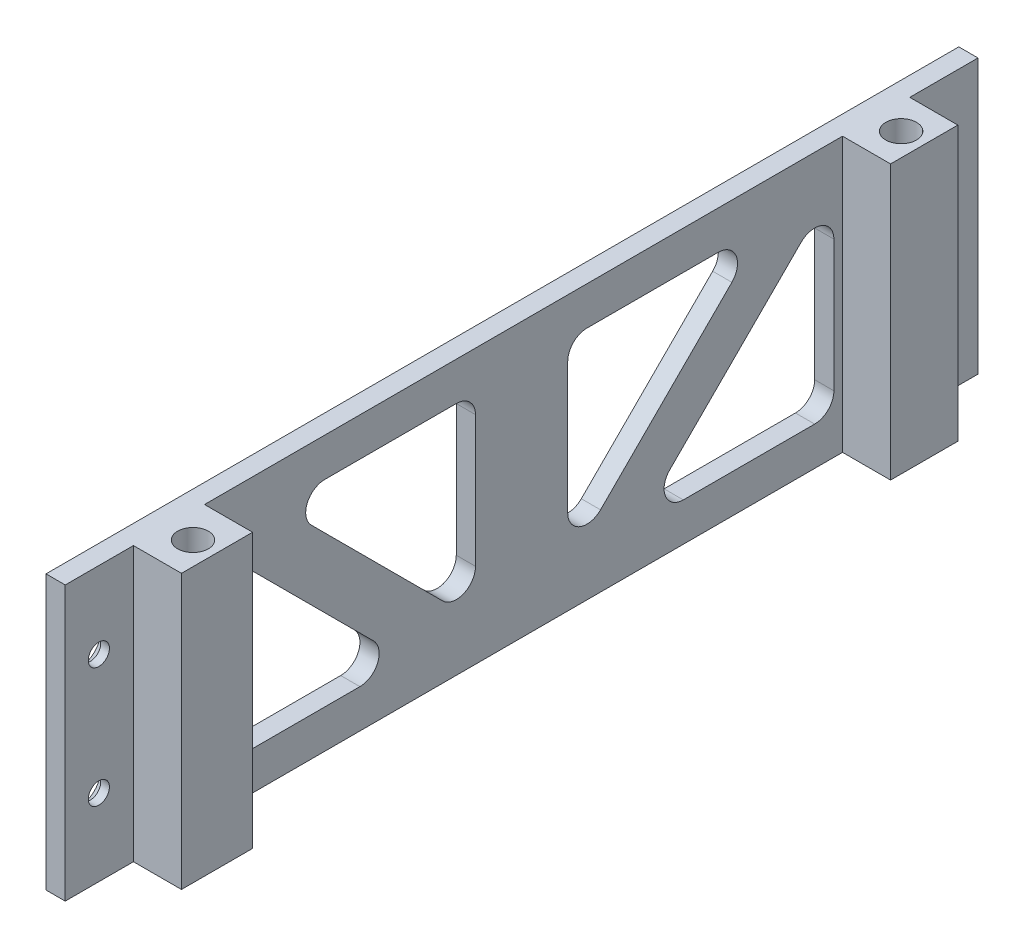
from build123d import *

# Parameters (mm, degrees)
SKETCH1_W                                           = 95
SKETCH1_H                                           = 28.5
BOSS_EXTRUDE1_DEPTH                                 = 2
SKETCH3_W                                           = 7.4
SKETCH3_H                                           = 28.5
SKETCH3_W_2                                         = 7
BOSS_EXTRUDE3_DEPTH                                 = 5
F_3_2_3_2_DIAMETER_HOLE1_D                          = 3.2
CSK_FOR_M2_COUNTERSUNK_FLAT_HEAD_SCREW1_D           = 2.2
CSK_FOR_M2_COUNTERSUNK_FLAT_HEAD_SCREW1_DEPTH       = 2
CSK_FOR_M2_COUNTERSUNK_FLAT_HEAD_SCREW1_CSINK_D     = 4.4
CSK_FOR_M2_COUNTERSUNK_FLAT_HEAD_SCREW1_CSINK_ANGLE = 90
CSK_FOR_M2_COUNTERSUNK_FLAT_HEAD_SCREW1_TIP         = 0.660946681
CUT_EXTRUDE1_DEPTH                                  = 10


with BuildPart() as part:
    # Sketch1 → Boss-Extrude1 (new body)
    with BuildSketch(Plane(origin=(0, 0, 0), x_dir=(0, 0, -1), z_dir=(1, 0, 0))):
        Rectangle(SKETCH1_W, SKETCH1_H)
    extrude(amount=BOSS_EXTRUDE1_DEPTH)

    # Sketch3 → Boss-Extrude3 (add)
    with BuildSketch(Plane(origin=(2, 0, 0), x_dir=(0, 0, -1), z_dir=(1, 0, 0))):
        with Locations((-36.7, 0)):
            Rectangle(SKETCH3_W, SKETCH3_H)
        with Locations((36.9, 0)):
            Rectangle(SKETCH3_W_2, SKETCH3_H)
    extrude(amount=BOSS_EXTRUDE3_DEPTH)

    # 3.2 _3.2_ Diameter Hole1 (through all)
    with Locations(Plane(origin=(0, 14.25, 0), x_dir=(1, 0, 0), z_dir=(0, 1, 0))):
        with Locations((4.6, 36.9), (4.6, -36.8)):
            Hole(F_3_2_3_2_DIAMETER_HOLE1_D / 2)

    # CSK for M2 Countersunk Flat Head Screw1
    with Locations(Plane.ZY):
        with Locations((-44, 6.25), (-44, -6.25), (44, 6.25), (44, -6.25)):
            CounterSinkHole(CSK_FOR_M2_COUNTERSUNK_FLAT_HEAD_SCREW1_D / 2, CSK_FOR_M2_COUNTERSUNK_FLAT_HEAD_SCREW1_CSINK_D / 2, depth=CSK_FOR_M2_COUNTERSUNK_FLAT_HEAD_SCREW1_DEPTH, counter_sink_angle=CSK_FOR_M2_COUNTERSUNK_FLAT_HEAD_SCREW1_CSINK_ANGLE)
            with Locations((0, 0, -(CSK_FOR_M2_COUNTERSUNK_FLAT_HEAD_SCREW1_DEPTH + CSK_FOR_M2_COUNTERSUNK_FLAT_HEAD_SCREW1_TIP / 2))):  # 118° drill point
                Cone(0, CSK_FOR_M2_COUNTERSUNK_FLAT_HEAD_SCREW1_D / 2, CSK_FOR_M2_COUNTERSUNK_FLAT_HEAD_SCREW1_TIP, mode=Mode.SUBTRACT)

    # Sketch8 → Cut-Extrude1 (cut)
    with BuildSketch(Plane.ZY):
        with BuildLine():
            Line((-32.5, 5.421572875), (-32.5, -8.25))
            ThreePointArc((-32.5, -8.25), (-31.914213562, -9.664213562), (-30.5, -10.25))
            Line((-30.5, -10.25), (-16.828427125, -10.25))
            ThreePointArc((-16.828427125, -10.25), (-14.98066806, -9.015366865), (-15.414213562, -6.835786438))
            Line((-15.414213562, -6.835786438), (-29.085786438, 6.835786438))
            ThreePointArc((-29.085786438, 6.835786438), (-31.265366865, 7.26933194), (-32.5, 5.421572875))
        make_face()
        with BuildLine():
            Line((-20.471572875, 10.25), (-6.8, 10.25))
            ThreePointArc((-6.8, 10.25), (-5.385786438, 9.664213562), (-4.8, 8.25))
            Line((-4.8, 8.25), (-4.8, -5.421572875))
            ThreePointArc((-4.8, -5.421572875), (-6.034633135, -7.26933194), (-8.214213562, -6.835786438))
            Line((-8.214213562, -6.835786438), (-21.885786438, 6.835786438))
            ThreePointArc((-21.885786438, 6.835786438), (-22.31933194, 9.015366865), (-20.471572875, 10.25))
        make_face()
    cut_extrude1 = extrude(amount=-CUT_EXTRUDE1_DEPTH, mode=Mode.SUBTRACT)

    # Mirror1: Cut-Extrude1 across plane
    add(cut_extrude1.mirror(Plane.XY), mode=Mode.SUBTRACT)


solid = part.part
